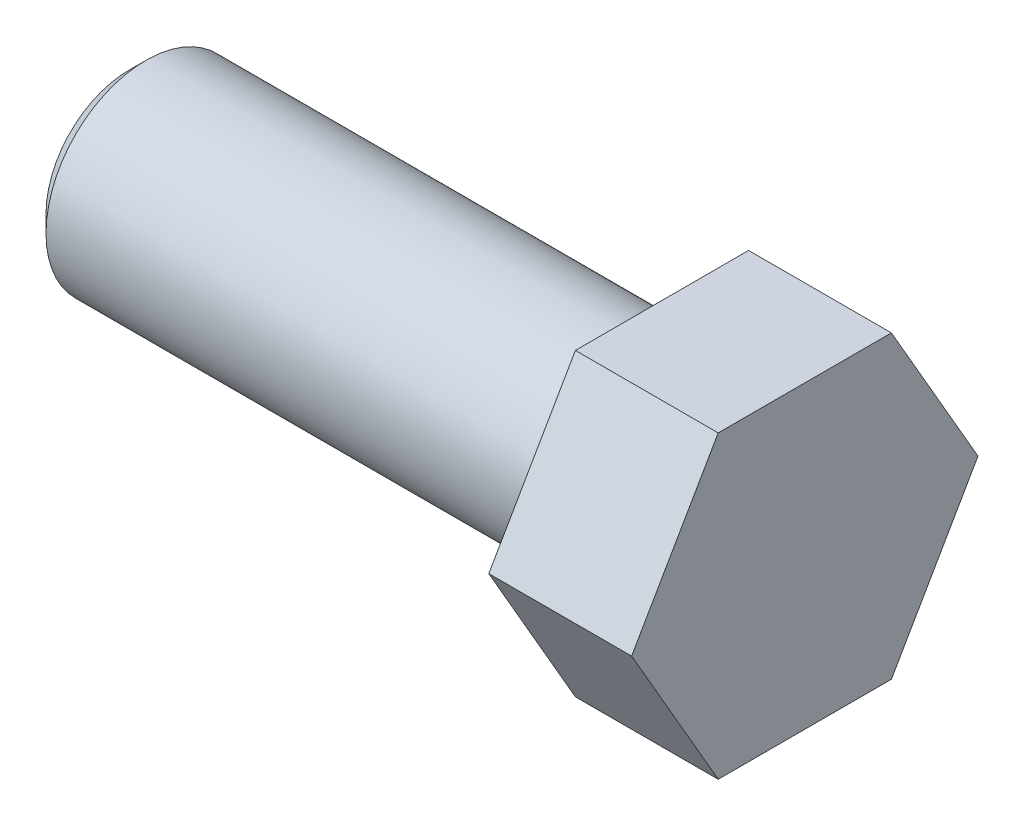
from build123d import *

# Parameters (mm, degrees)
SKETCH2_OUTSIDE_W  = 26.466
SKETCH2_OUTSIDE_H  = 26.466
CUT_EXTRUDE1_DEPTH = 35.257755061


with BuildPart() as part:
    # Sketch1 → Revolve1 (revolve)
    with BuildSketch(Plane.XY, mode=Mode.PRIVATE) as revolve1_sk:
        Polygon((-32.2072, 0), (-32.2072, 3.95923445), (-31.40393445, 4.7625), (-6.8072, 4.7625), (-6.8072, 8.255), (0, 8.255), (0, 0), align=None)
    revolve(revolve1_sk.sketch.rotate(Axis((-32.2072, 0, 0), (1, 0, 0)), 90), axis=Axis((-32.2072, 0, 0), (1, 0, 0)))

    # Sketch2 outside → Cut-Extrude1 (cut, through all)
    with BuildSketch(Plane(origin=(0, 0, 0), x_dir=(0, 0, -1), z_dir=(1, 0, 0))):
        Rectangle(SKETCH2_OUTSIDE_W, SKETCH2_OUTSIDE_H)
        Polygon((-8.255, 0), (-4.1275, -7.149039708), (4.1275, -7.149039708), (8.255, 0), (4.1275, 7.149039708), (-4.1275, 7.149039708), align=None, mode=Mode.SUBTRACT)
    extrude(amount=-CUT_EXTRUDE1_DEPTH, mode=Mode.SUBTRACT)


solid = part.part
